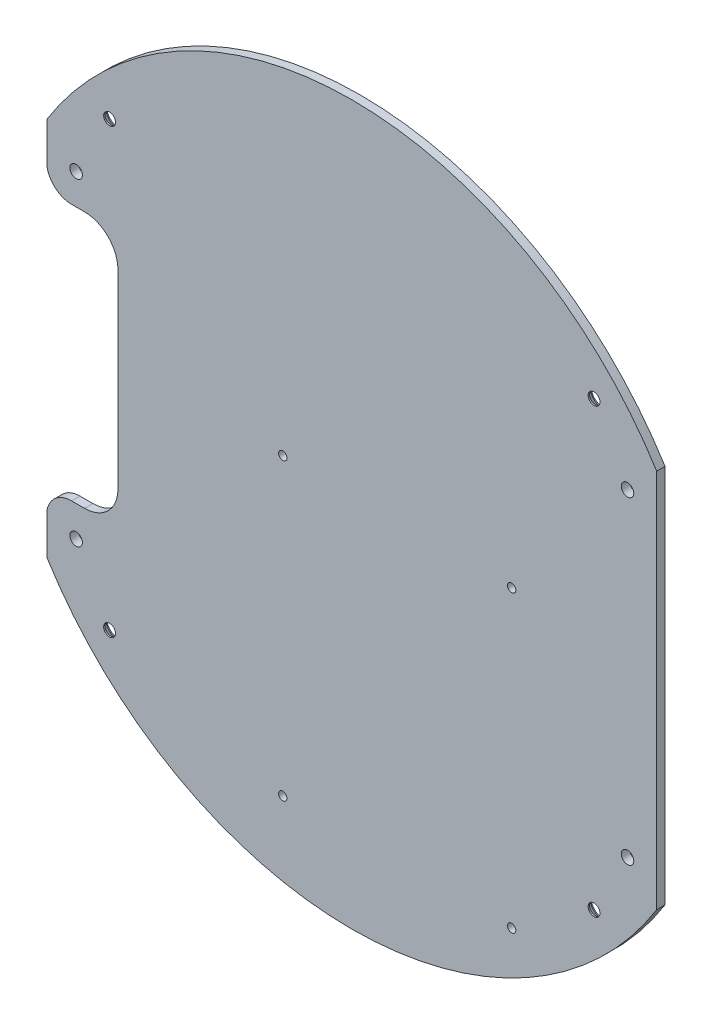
ISO-10303-21;
HEADER;
FILE_DESCRIPTION(('STEP AP214'),'2;1');
FILE_NAME('part.step','',(''),(''),'','','');
FILE_SCHEMA(('AUTOMOTIVE_DESIGN { 1 0 10303 214 1 1 1 1 }'));
ENDSEC;
DATA;
#1=APPLICATION_CONTEXT('core data for automotive mechanical design processes');
#2=APPLICATION_PROTOCOL_DEFINITION('international standard','automotive_design',2000,#1);
#3=PRODUCT_CONTEXT('',#1,'mechanical');
#4=PRODUCT('Part','Part','',(#3));
#5=PRODUCT_RELATED_PRODUCT_CATEGORY('part','',(#4));
#6=PRODUCT_DEFINITION_FORMATION('','',#4);
#7=PRODUCT_DEFINITION_CONTEXT('part definition',#1,'design');
#8=PRODUCT_DEFINITION('design','',#6,#7);
#9=PRODUCT_DEFINITION_SHAPE('','',#8);
#10=(LENGTH_UNIT() NAMED_UNIT(*) SI_UNIT(.MILLI.,.METRE.));
#11=(NAMED_UNIT(*) PLANE_ANGLE_UNIT() SI_UNIT($,.RADIAN.));
#12=(NAMED_UNIT(*) SI_UNIT($,.STERADIAN.) SOLID_ANGLE_UNIT());
#13=UNCERTAINTY_MEASURE_WITH_UNIT(LENGTH_MEASURE(1.E-05),#10,'distance_accuracy_value','');
#14=(GEOMETRIC_REPRESENTATION_CONTEXT(3) GLOBAL_UNCERTAINTY_ASSIGNED_CONTEXT((#13)) GLOBAL_UNIT_ASSIGNED_CONTEXT((#10,
#11,#12)) REPRESENTATION_CONTEXT('',''));
#15=CARTESIAN_POINT('',(0.,0.,0.));
#16=DIRECTION('',(0.,0.,1.));
#17=DIRECTION('',(1.,0.,0.));
#18=AXIS2_PLACEMENT_3D('',#15,#16,#17);
#19=CARTESIAN_POINT('',(0.,-63.5,3.175));
#20=DIRECTION('',(0.,0.,1.));
#21=DIRECTION('',(1.,0.,0.));
#22=AXIS2_PLACEMENT_3D('',#19,#20,#21);
#23=PLANE('',#22);
#24=CARTESIAN_POINT('',(-92.075,20.6375,3.17500000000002));
#25=DIRECTION('',(0.,0.,-1.));
#26=DIRECTION('',(-1.,0.,0.));
#27=AXIS2_PLACEMENT_3D('',#24,#25,#26);
#28=CIRCLE('',#27,2.2479);
#29=CARTESIAN_POINT('',(-94.3229,20.6375,3.17500000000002));
#30=VERTEX_POINT('',#29);
#31=EDGE_CURVE('E592',#30,#30,#28,.T.);
#32=ORIENTED_EDGE('',*,*,#31,.T.);
#33=EDGE_LOOP('',(#32));
#34=FACE_BOUND('',#33,.T.);
#35=CARTESIAN_POINT('',(92.075,-147.6375,3.17500000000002));
#36=DIRECTION('',(0.,0.,-1.));
#37=DIRECTION('',(-1.,0.,0.));
#38=AXIS2_PLACEMENT_3D('',#35,#36,#37);
#39=CIRCLE('',#38,2.2479);
#40=CARTESIAN_POINT('',(89.8271,-147.6375,3.17500000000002));
#41=VERTEX_POINT('',#40);
#42=EDGE_CURVE('E615',#41,#41,#39,.T.);
#43=ORIENTED_EDGE('',*,*,#42,.T.);
#44=EDGE_LOOP('',(#43));
#45=FACE_BOUND('',#44,.T.);
#46=CARTESIAN_POINT('',(60.7441,-169.291,3.17500000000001));
#47=DIRECTION('',(0.,0.,-1.));
#48=DIRECTION('',(0.,1.,0.));
#49=AXIS2_PLACEMENT_3D('',#46,#47,#48);
#50=CIRCLE('',#49,1.5875);
#51=CARTESIAN_POINT('',(60.7441,-167.7035,3.17500000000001));
#52=VERTEX_POINT('',#51);
#53=EDGE_CURVE('E630',#52,#52,#50,.T.);
#54=ORIENTED_EDGE('',*,*,#53,.T.);
#55=EDGE_LOOP('',(#54));
#56=FACE_BOUND('',#55,.T.);
#57=CARTESIAN_POINT('',(60.7441,-57.277,3.17500000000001));
#58=DIRECTION('',(0.,0.,-1.));
#59=DIRECTION('',(0.,1.,0.));
#60=AXIS2_PLACEMENT_3D('',#57,#58,#59);
#61=CIRCLE('',#60,1.5875);
#62=CARTESIAN_POINT('',(60.7441,-55.6895,3.17500000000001));
#63=VERTEX_POINT('',#62);
#64=EDGE_CURVE('E636',#63,#63,#61,.T.);
#65=ORIENTED_EDGE('',*,*,#64,.T.);
#66=EDGE_LOOP('',(#65));
#67=FACE_BOUND('',#66,.T.);
#68=CARTESIAN_POINT('',(-26.2509,-57.277,3.17500000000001));
#69=DIRECTION('',(0.,0.,-1.));
#70=DIRECTION('',(0.,1.,0.));
#71=AXIS2_PLACEMENT_3D('',#68,#69,#70);
#72=CIRCLE('',#71,1.5875);
#73=CARTESIAN_POINT('',(-26.2509,-55.6895,3.17500000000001));
#74=VERTEX_POINT('',#73);
#75=EDGE_CURVE('E642',#74,#74,#72,.T.);
#76=ORIENTED_EDGE('',*,*,#75,.T.);
#77=EDGE_LOOP('',(#76));
#78=FACE_BOUND('',#77,.T.);
#79=CARTESIAN_POINT('',(-26.2509,-169.291,3.17500000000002));
#80=DIRECTION('',(0.,0.,-1.));
#81=DIRECTION('',(0.,1.,0.));
#82=AXIS2_PLACEMENT_3D('',#79,#80,#81);
#83=CIRCLE('',#82,1.5875);
#84=CARTESIAN_POINT('',(-26.2509,-167.7035,3.17500000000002));
#85=VERTEX_POINT('',#84);
#86=EDGE_CURVE('E648',#85,#85,#83,.T.);
#87=ORIENTED_EDGE('',*,*,#86,.T.);
#88=EDGE_LOOP('',(#87));
#89=FACE_BOUND('',#88,.T.);
#90=CARTESIAN_POINT('',(-104.793923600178,-2.99719999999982,3.175));
#91=DIRECTION('',(0.,0.,1.));
#92=DIRECTION('',(-1.,0.,0.));
#93=AXIS2_PLACEMENT_3D('',#90,#91,#92);
#94=CIRCLE('',#93,2.38125000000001);
#95=CARTESIAN_POINT('',(-107.175173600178,-2.99719999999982,3.175));
#96=VERTEX_POINT('',#95);
#97=EDGE_CURVE('E651',#96,#96,#94,.T.);
#98=ORIENTED_EDGE('',*,*,#97,.F.);
#99=EDGE_LOOP('',(#98));
#100=FACE_BOUND('',#99,.T.);
#101=CARTESIAN_POINT('',(-104.793923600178,-124.0028,3.175));
#102=DIRECTION('',(0.,0.,1.));
#103=DIRECTION('',(1.,0.,0.));
#104=AXIS2_PLACEMENT_3D('',#101,#102,#103);
#105=CIRCLE('',#104,2.38125);
#106=CARTESIAN_POINT('',(-102.412673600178,-124.0028,3.175));
#107=VERTEX_POINT('',#106);
#108=EDGE_CURVE('E657',#107,#107,#105,.T.);
#109=ORIENTED_EDGE('',*,*,#108,.F.);
#110=EDGE_LOOP('',(#109));
#111=FACE_BOUND('',#110,.T.);
#112=CARTESIAN_POINT('',(104.793923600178,-124.0028,3.175));
#113=DIRECTION('',(0.,0.,1.));
#114=DIRECTION('',(-1.,0.,0.));
#115=AXIS2_PLACEMENT_3D('',#112,#113,#114);
#116=CIRCLE('',#115,2.38125);
#117=CARTESIAN_POINT('',(102.412673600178,-124.0028,3.175));
#118=VERTEX_POINT('',#117);
#119=EDGE_CURVE('E663',#118,#118,#116,.T.);
#120=ORIENTED_EDGE('',*,*,#119,.F.);
#121=EDGE_LOOP('',(#120));
#122=FACE_BOUND('',#121,.T.);
#123=CARTESIAN_POINT('',(104.793923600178,-2.99719999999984,3.175));
#124=DIRECTION('',(0.,0.,1.));
#125=DIRECTION('',(1.,0.,0.));
#126=AXIS2_PLACEMENT_3D('',#123,#124,#125);
#127=CIRCLE('',#126,2.38125000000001);
#128=CARTESIAN_POINT('',(107.175173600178,-2.99719999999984,3.175));
#129=VERTEX_POINT('',#128);
#130=EDGE_CURVE('E156',#129,#129,#127,.T.);
#131=ORIENTED_EDGE('',*,*,#130,.F.);
#132=EDGE_LOOP('',(#131));
#133=FACE_BOUND('',#132,.T.);
#134=DIRECTION('',(-1.,0.,0.));
#135=VECTOR('',#134,1.);
#136=CARTESIAN_POINT('',(-106.51914883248,-112.3065313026,3.175));
#137=LINE('',#136,#135);
#138=CARTESIAN_POINT('',(-101.6,-112.3065313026,3.175));
#139=VERTEX_POINT('',#138);
#140=CARTESIAN_POINT('',(-106.51914883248,-112.3065313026,3.175));
#141=VERTEX_POINT('',#140);
#142=EDGE_CURVE('E144',#139,#141,#137,.T.);
#143=ORIENTED_EDGE('',*,*,#142,.T.);
#144=CARTESIAN_POINT('',(-106.51914883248,-121.8315313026,3.175));
#145=DIRECTION('',(0.,0.,1.));
#146=DIRECTION('',(1.,0.,0.));
#147=AXIS2_PLACEMENT_3D('',#144,#145,#146);
#148=CIRCLE('',#147,9.525);
#149=CARTESIAN_POINT('',(-115.8875,-120.111176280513,3.175));
#150=VERTEX_POINT('',#149);
#151=EDGE_CURVE('E150',#141,#150,#148,.T.);
#152=ORIENTED_EDGE('',*,*,#151,.T.);
#153=DIRECTION('',(0.,1.,0.));
#154=VECTOR('',#153,1.);
#155=CARTESIAN_POINT('',(-115.8875,-135.6745313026,3.175));
#156=LINE('',#155,#154);
#157=CARTESIAN_POINT('',(-115.8875,-135.6745313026,3.175));
#158=VERTEX_POINT('',#157);
#159=EDGE_CURVE('E171',#158,#150,#156,.T.);
#160=ORIENTED_EDGE('',*,*,#159,.F.);
#161=CARTESIAN_POINT('',(0.,-63.5,3.175));
#162=DIRECTION('',(0.,0.,-1.));
#163=DIRECTION('',(1.,0.,0.));
#164=AXIS2_PLACEMENT_3D('',#161,#162,#163);
#165=CIRCLE('',#164,136.525);
#166=CARTESIAN_POINT('',(115.8875,-135.6745313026,3.175));
#167=VERTEX_POINT('',#166);
#168=EDGE_CURVE('E174',#167,#158,#165,.T.);
#169=ORIENTED_EDGE('',*,*,#168,.F.);
#170=DIRECTION('',(0.,1.,0.));
#171=VECTOR('',#170,1.);
#172=CARTESIAN_POINT('',(115.8875,8.67453130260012,3.175));
#173=LINE('',#172,#171);
#174=CARTESIAN_POINT('',(115.8875,8.67453130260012,3.175));
#175=VERTEX_POINT('',#174);
#176=EDGE_CURVE('E211',#167,#175,#173,.T.);
#177=ORIENTED_EDGE('',*,*,#176,.T.);
#178=CARTESIAN_POINT('',(0.,-63.5,3.175));
#179=DIRECTION('',(0.,0.,1.));
#180=DIRECTION('',(1.,0.,0.));
#181=AXIS2_PLACEMENT_3D('',#178,#179,#180);
#182=CIRCLE('',#181,136.525);
#183=CARTESIAN_POINT('',(-115.8875,8.67453130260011,3.175));
#184=VERTEX_POINT('',#183);
#185=EDGE_CURVE('E57',#175,#184,#182,.T.);
#186=ORIENTED_EDGE('',*,*,#185,.T.);
#187=DIRECTION('',(0.,-1.,0.));
#188=VECTOR('',#187,1.);
#189=CARTESIAN_POINT('',(-115.8875,8.6745313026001,3.175));
#190=LINE('',#189,#188);
#191=CARTESIAN_POINT('',(-115.8875,-6.88882371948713,3.175));
#192=VERTEX_POINT('',#191);
#193=EDGE_CURVE('E209',#184,#192,#190,.T.);
#194=ORIENTED_EDGE('',*,*,#193,.T.);
#195=CARTESIAN_POINT('',(-106.51914883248,-5.16846869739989,3.175));
#196=DIRECTION('',(0.,0.,-1.));
#197=DIRECTION('',(1.,0.,0.));
#198=AXIS2_PLACEMENT_3D('',#195,#196,#197);
#199=CIRCLE('',#198,9.525);
#200=CARTESIAN_POINT('',(-106.51914883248,-14.6934686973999,3.175));
#201=VERTEX_POINT('',#200);
#202=EDGE_CURVE('E135',#201,#192,#199,.T.);
#203=ORIENTED_EDGE('',*,*,#202,.F.);
#204=DIRECTION('',(-1.,0.,0.));
#205=VECTOR('',#204,1.);
#206=CARTESIAN_POINT('',(-106.51914883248,-14.6934686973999,3.175));
#207=LINE('',#206,#205);
#208=CARTESIAN_POINT('',(-101.6,-14.6934686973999,3.175));
#209=VERTEX_POINT('',#208);
#210=EDGE_CURVE('E183',#209,#201,#207,.T.);
#211=ORIENTED_EDGE('',*,*,#210,.F.);
#212=CARTESIAN_POINT('',(-101.6,-27.3934686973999,3.175));
#213=DIRECTION('',(0.,0.,1.));
#214=DIRECTION('',(1.,0.,0.));
#215=AXIS2_PLACEMENT_3D('',#212,#213,#214);
#216=CIRCLE('',#215,12.7);
#217=CARTESIAN_POINT('',(-88.9,-27.3934686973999,3.175));
#218=VERTEX_POINT('',#217);
#219=EDGE_CURVE('E130',#218,#209,#216,.T.);
#220=ORIENTED_EDGE('',*,*,#219,.F.);
#221=DIRECTION('',(0.,1.,0.));
#222=VECTOR('',#221,1.);
#223=CARTESIAN_POINT('',(-88.9,-27.3934686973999,3.175));
#224=LINE('',#223,#222);
#225=CARTESIAN_POINT('',(-88.9,-99.6065313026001,3.175));
#226=VERTEX_POINT('',#225);
#227=EDGE_CURVE('E122',#226,#218,#224,.T.);
#228=ORIENTED_EDGE('',*,*,#227,.F.);
#229=CARTESIAN_POINT('',(-101.6,-99.6065313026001,3.175));
#230=DIRECTION('',(0.,0.,-1.));
#231=DIRECTION('',(1.,0.,0.));
#232=AXIS2_PLACEMENT_3D('',#229,#230,#231);
#233=CIRCLE('',#232,12.7);
#234=EDGE_CURVE('E127',#226,#139,#233,.T.);
#235=ORIENTED_EDGE('',*,*,#234,.T.);
#236=EDGE_LOOP('',(#143,#152,#160,#169,#177,#186,#194,#203,#211,#220,#228,#235));
#237=FACE_BOUND('',#236,.T.);
#238=CARTESIAN_POINT('',(92.075,20.6375,3.17500000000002));
#239=DIRECTION('',(0.,0.,-1.));
#240=DIRECTION('',(-1.,0.,0.));
#241=AXIS2_PLACEMENT_3D('',#238,#239,#240);
#242=CIRCLE('',#241,2.2479);
#243=CARTESIAN_POINT('',(89.8271,20.6375,3.17500000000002));
#244=VERTEX_POINT('',#243);
#245=EDGE_CURVE('E603',#244,#244,#242,.T.);
#246=ORIENTED_EDGE('',*,*,#245,.T.);
#247=EDGE_LOOP('',(#246));
#248=FACE_BOUND('',#247,.T.);
#249=CARTESIAN_POINT('',(-92.075,-147.6375,3.17500000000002));
#250=DIRECTION('',(0.,0.,-1.));
#251=DIRECTION('',(-1.,0.,0.));
#252=AXIS2_PLACEMENT_3D('',#249,#250,#251);
#253=CIRCLE('',#252,2.2479);
#254=CARTESIAN_POINT('',(-94.3229,-147.6375,3.17500000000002));
#255=VERTEX_POINT('',#254);
#256=EDGE_CURVE('E579',#255,#255,#253,.T.);
#257=ORIENTED_EDGE('',*,*,#256,.T.);
#258=EDGE_LOOP('',(#257));
#259=FACE_BOUND('',#258,.T.);
#260=ADVANCED_FACE('F34',(#34,#45,#56,#67,#78,#89,#100,#111,#122,#133,#237,#248,#259),#23,.T.);
#261=CARTESIAN_POINT('',(0.,-63.5,0.));
#262=DIRECTION('',(0.,0.,1.));
#263=DIRECTION('',(1.,0.,0.));
#264=AXIS2_PLACEMENT_3D('',#261,#262,#263);
#265=PLANE('',#264);
#266=CARTESIAN_POINT('',(-92.075,-147.6375,0.));
#267=DIRECTION('',(0.,0.,-1.));
#268=DIRECTION('',(-1.,0.,0.));
#269=AXIS2_PLACEMENT_3D('',#266,#267,#268);
#270=CIRCLE('',#269,4.21639999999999);
#271=CARTESIAN_POINT('',(-96.2914,-147.6375,0.));
#272=VERTEX_POINT('',#271);
#273=EDGE_CURVE('E586',#272,#272,#270,.T.);
#274=ORIENTED_EDGE('',*,*,#273,.F.);
#275=EDGE_LOOP('',(#274));
#276=FACE_BOUND('',#275,.T.);
#277=CARTESIAN_POINT('',(-92.075,20.6375,0.));
#278=DIRECTION('',(0.,0.,-1.));
#279=DIRECTION('',(-1.,0.,0.));
#280=AXIS2_PLACEMENT_3D('',#277,#278,#279);
#281=CIRCLE('',#280,4.21639999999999);
#282=CARTESIAN_POINT('',(-96.2914,20.6375,0.));
#283=VERTEX_POINT('',#282);
#284=EDGE_CURVE('E600',#283,#283,#281,.T.);
#285=ORIENTED_EDGE('',*,*,#284,.F.);
#286=EDGE_LOOP('',(#285));
#287=FACE_BOUND('',#286,.T.);
#288=CARTESIAN_POINT('',(92.075,20.6375,0.));
#289=DIRECTION('',(0.,0.,-1.));
#290=DIRECTION('',(-1.,0.,0.));
#291=AXIS2_PLACEMENT_3D('',#288,#289,#290);
#292=CIRCLE('',#291,4.21639999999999);
#293=CARTESIAN_POINT('',(87.8586,20.6375,0.));
#294=VERTEX_POINT('',#293);
#295=EDGE_CURVE('E612',#294,#294,#292,.T.);
#296=ORIENTED_EDGE('',*,*,#295,.F.);
#297=EDGE_LOOP('',(#296));
#298=FACE_BOUND('',#297,.T.);
#299=CARTESIAN_POINT('',(92.075,-147.6375,0.));
#300=DIRECTION('',(0.,0.,-1.));
#301=DIRECTION('',(-1.,0.,0.));
#302=AXIS2_PLACEMENT_3D('',#299,#300,#301);
#303=CIRCLE('',#302,4.21639999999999);
#304=CARTESIAN_POINT('',(87.8586,-147.6375,0.));
#305=VERTEX_POINT('',#304);
#306=EDGE_CURVE('E624',#305,#305,#303,.T.);
#307=ORIENTED_EDGE('',*,*,#306,.F.);
#308=EDGE_LOOP('',(#307));
#309=FACE_BOUND('',#308,.T.);
#310=CARTESIAN_POINT('',(60.7441,-169.291,0.));
#311=DIRECTION('',(0.,0.,-1.));
#312=DIRECTION('',(0.,1.,0.));
#313=AXIS2_PLACEMENT_3D('',#310,#311,#312);
#314=CIRCLE('',#313,1.5875);
#315=CARTESIAN_POINT('',(60.7441,-167.7035,0.));
#316=VERTEX_POINT('',#315);
#317=EDGE_CURVE('E627',#316,#316,#314,.T.);
#318=ORIENTED_EDGE('',*,*,#317,.F.);
#319=EDGE_LOOP('',(#318));
#320=FACE_BOUND('',#319,.T.);
#321=CARTESIAN_POINT('',(60.7441,-57.277,0.));
#322=DIRECTION('',(0.,0.,-1.));
#323=DIRECTION('',(0.,1.,0.));
#324=AXIS2_PLACEMENT_3D('',#321,#322,#323);
#325=CIRCLE('',#324,1.5875);
#326=CARTESIAN_POINT('',(60.7441,-55.6895,0.));
#327=VERTEX_POINT('',#326);
#328=EDGE_CURVE('E633',#327,#327,#325,.T.);
#329=ORIENTED_EDGE('',*,*,#328,.F.);
#330=EDGE_LOOP('',(#329));
#331=FACE_BOUND('',#330,.T.);
#332=CARTESIAN_POINT('',(-26.2509,-57.277,0.));
#333=DIRECTION('',(0.,0.,-1.));
#334=DIRECTION('',(0.,1.,0.));
#335=AXIS2_PLACEMENT_3D('',#332,#333,#334);
#336=CIRCLE('',#335,1.5875);
#337=CARTESIAN_POINT('',(-26.2509,-55.6895,0.));
#338=VERTEX_POINT('',#337);
#339=EDGE_CURVE('E639',#338,#338,#336,.T.);
#340=ORIENTED_EDGE('',*,*,#339,.F.);
#341=EDGE_LOOP('',(#340));
#342=FACE_BOUND('',#341,.T.);
#343=CARTESIAN_POINT('',(-26.2509,-169.291,0.));
#344=DIRECTION('',(0.,0.,-1.));
#345=DIRECTION('',(0.,1.,0.));
#346=AXIS2_PLACEMENT_3D('',#343,#344,#345);
#347=CIRCLE('',#346,1.5875);
#348=CARTESIAN_POINT('',(-26.2509,-167.7035,0.));
#349=VERTEX_POINT('',#348);
#350=EDGE_CURVE('E645',#349,#349,#347,.T.);
#351=ORIENTED_EDGE('',*,*,#350,.F.);
#352=EDGE_LOOP('',(#351));
#353=FACE_BOUND('',#352,.T.);
#354=CARTESIAN_POINT('',(-104.793923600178,-2.99719999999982,0.));
#355=DIRECTION('',(0.,0.,1.));
#356=DIRECTION('',(-1.,0.,0.));
#357=AXIS2_PLACEMENT_3D('',#354,#355,#356);
#358=CIRCLE('',#357,2.38125000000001);
#359=CARTESIAN_POINT('',(-107.175173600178,-2.99719999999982,0.));
#360=VERTEX_POINT('',#359);
#361=EDGE_CURVE('E654',#360,#360,#358,.T.);
#362=ORIENTED_EDGE('',*,*,#361,.T.);
#363=EDGE_LOOP('',(#362));
#364=FACE_BOUND('',#363,.T.);
#365=CARTESIAN_POINT('',(-104.793923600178,-124.0028,0.));
#366=DIRECTION('',(0.,0.,1.));
#367=DIRECTION('',(1.,0.,0.));
#368=AXIS2_PLACEMENT_3D('',#365,#366,#367);
#369=CIRCLE('',#368,2.38125);
#370=CARTESIAN_POINT('',(-102.412673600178,-124.0028,0.));
#371=VERTEX_POINT('',#370);
#372=EDGE_CURVE('E660',#371,#371,#369,.T.);
#373=ORIENTED_EDGE('',*,*,#372,.T.);
#374=EDGE_LOOP('',(#373));
#375=FACE_BOUND('',#374,.T.);
#376=CARTESIAN_POINT('',(104.793923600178,-124.0028,0.));
#377=DIRECTION('',(0.,0.,1.));
#378=DIRECTION('',(-1.,0.,0.));
#379=AXIS2_PLACEMENT_3D('',#376,#377,#378);
#380=CIRCLE('',#379,2.38125);
#381=CARTESIAN_POINT('',(102.412673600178,-124.0028,0.));
#382=VERTEX_POINT('',#381);
#383=EDGE_CURVE('E666',#382,#382,#380,.T.);
#384=ORIENTED_EDGE('',*,*,#383,.T.);
#385=EDGE_LOOP('',(#384));
#386=FACE_BOUND('',#385,.T.);
#387=CARTESIAN_POINT('',(104.793923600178,-2.99719999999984,0.));
#388=DIRECTION('',(0.,0.,1.));
#389=DIRECTION('',(1.,0.,0.));
#390=AXIS2_PLACEMENT_3D('',#387,#388,#389);
#391=CIRCLE('',#390,2.38125000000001);
#392=CARTESIAN_POINT('',(107.175173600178,-2.99719999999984,0.));
#393=VERTEX_POINT('',#392);
#394=EDGE_CURVE('E151',#393,#393,#391,.T.);
#395=ORIENTED_EDGE('',*,*,#394,.T.);
#396=EDGE_LOOP('',(#395));
#397=FACE_BOUND('',#396,.T.);
#398=CARTESIAN_POINT('',(-106.51914883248,-121.8315313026,0.));
#399=DIRECTION('',(0.,0.,1.));
#400=DIRECTION('',(1.,0.,0.));
#401=AXIS2_PLACEMENT_3D('',#398,#399,#400);
#402=CIRCLE('',#401,9.525);
#403=CARTESIAN_POINT('',(-106.51914883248,-112.3065313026,0.));
#404=VERTEX_POINT('',#403);
#405=CARTESIAN_POINT('',(-115.8875,-120.111176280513,0.));
#406=VERTEX_POINT('',#405);
#407=EDGE_CURVE('E162',#404,#406,#402,.T.);
#408=ORIENTED_EDGE('',*,*,#407,.F.);
#409=DIRECTION('',(-1.,0.,0.));
#410=VECTOR('',#409,1.);
#411=CARTESIAN_POINT('',(0.,-112.3065313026,0.));
#412=LINE('',#411,#410);
#413=CARTESIAN_POINT('',(-101.6,-112.3065313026,0.));
#414=VERTEX_POINT('',#413);
#415=EDGE_CURVE('E11',#414,#404,#412,.T.);
#416=ORIENTED_EDGE('',*,*,#415,.F.);
#417=CARTESIAN_POINT('',(-101.6,-99.6065313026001,0.));
#418=DIRECTION('',(0.,0.,1.));
#419=DIRECTION('',(1.,0.,0.));
#420=AXIS2_PLACEMENT_3D('',#417,#418,#419);
#421=CIRCLE('',#420,12.7);
#422=CARTESIAN_POINT('',(-88.9,-99.6065313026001,0.));
#423=VERTEX_POINT('',#422);
#424=EDGE_CURVE('E42',#423,#414,#421,.F.);
#425=ORIENTED_EDGE('',*,*,#424,.F.);
#426=DIRECTION('',(0.,1.,0.));
#427=VECTOR('',#426,1.);
#428=CARTESIAN_POINT('',(-88.9,-63.5,0.));
#429=LINE('',#428,#427);
#430=CARTESIAN_POINT('',(-88.9,-27.3934686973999,0.));
#431=VERTEX_POINT('',#430);
#432=EDGE_CURVE('E140',#423,#431,#429,.T.);
#433=ORIENTED_EDGE('',*,*,#432,.T.);
#434=CARTESIAN_POINT('',(-101.6,-27.3934686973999,0.));
#435=DIRECTION('',(0.,0.,1.));
#436=DIRECTION('',(1.,0.,0.));
#437=AXIS2_PLACEMENT_3D('',#434,#435,#436);
#438=CIRCLE('',#437,12.7);
#439=CARTESIAN_POINT('',(-101.6,-14.6934686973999,0.));
#440=VERTEX_POINT('',#439);
#441=EDGE_CURVE('E134',#431,#440,#438,.T.);
#442=ORIENTED_EDGE('',*,*,#441,.T.);
#443=DIRECTION('',(-1.,0.,0.));
#444=VECTOR('',#443,1.);
#445=CARTESIAN_POINT('',(-106.51914883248,-14.6934686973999,0.));
#446=LINE('',#445,#444);
#447=CARTESIAN_POINT('',(-106.51914883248,-14.6934686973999,0.));
#448=VERTEX_POINT('',#447);
#449=EDGE_CURVE('E189',#440,#448,#446,.T.);
#450=ORIENTED_EDGE('',*,*,#449,.T.);
#451=CARTESIAN_POINT('',(-106.51914883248,-5.16846869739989,0.));
#452=DIRECTION('',(0.,0.,-1.));
#453=DIRECTION('',(1.,0.,0.));
#454=AXIS2_PLACEMENT_3D('',#451,#452,#453);
#455=CIRCLE('',#454,9.525);
#456=CARTESIAN_POINT('',(-115.8875,-6.88882371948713,0.));
#457=VERTEX_POINT('',#456);
#458=EDGE_CURVE('E49',#448,#457,#455,.T.);
#459=ORIENTED_EDGE('',*,*,#458,.T.);
#460=DIRECTION('',(0.,-1.,0.));
#461=VECTOR('',#460,1.);
#462=CARTESIAN_POINT('',(-115.8875,8.6745313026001,0.));
#463=LINE('',#462,#461);
#464=CARTESIAN_POINT('',(-115.8875,8.67453130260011,0.));
#465=VERTEX_POINT('',#464);
#466=EDGE_CURVE('E202',#465,#457,#463,.T.);
#467=ORIENTED_EDGE('',*,*,#466,.F.);
#468=CARTESIAN_POINT('',(0.,-63.5,0.));
#469=DIRECTION('',(0.,0.,1.));
#470=DIRECTION('',(1.,0.,0.));
#471=AXIS2_PLACEMENT_3D('',#468,#469,#470);
#472=CIRCLE('',#471,136.525);
#473=CARTESIAN_POINT('',(115.8875,8.67453130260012,0.));
#474=VERTEX_POINT('',#473);
#475=EDGE_CURVE('E207',#474,#465,#472,.T.);
#476=ORIENTED_EDGE('',*,*,#475,.F.);
#477=DIRECTION('',(0.,1.,0.));
#478=VECTOR('',#477,1.);
#479=CARTESIAN_POINT('',(115.8875,8.67453130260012,0.));
#480=LINE('',#479,#478);
#481=CARTESIAN_POINT('',(115.8875,-135.6745313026,0.));
#482=VERTEX_POINT('',#481);
#483=EDGE_CURVE('E205',#482,#474,#480,.T.);
#484=ORIENTED_EDGE('',*,*,#483,.F.);
#485=CARTESIAN_POINT('',(0.,-63.5,0.));
#486=DIRECTION('',(0.,0.,-1.));
#487=DIRECTION('',(1.,0.,0.));
#488=AXIS2_PLACEMENT_3D('',#485,#486,#487);
#489=CIRCLE('',#488,136.525);
#490=CARTESIAN_POINT('',(-115.8875,-135.6745313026,0.));
#491=VERTEX_POINT('',#490);
#492=EDGE_CURVE('E168',#482,#491,#489,.T.);
#493=ORIENTED_EDGE('',*,*,#492,.T.);
#494=DIRECTION('',(0.,1.,0.));
#495=VECTOR('',#494,1.);
#496=CARTESIAN_POINT('',(-115.8875,-135.6745313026,0.));
#497=LINE('',#496,#495);
#498=EDGE_CURVE('E165',#491,#406,#497,.T.);
#499=ORIENTED_EDGE('',*,*,#498,.T.);
#500=EDGE_LOOP('',(#408,#416,#425,#433,#442,#450,#459,#467,#476,#484,#493,#499));
#501=FACE_BOUND('',#500,.T.);
#502=ADVANCED_FACE('F233',(#276,#287,#298,#309,#320,#331,#342,#353,#364,#375,#386,#397,#501),
#265,.F.);
#503=CARTESIAN_POINT('',(-115.8875,-135.6745313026,3.175));
#504=DIRECTION('',(-1.,0.,0.));
#505=DIRECTION('',(0.,-1.,0.));
#506=AXIS2_PLACEMENT_3D('',#503,#504,#505);
#507=PLANE('',#506);
#508=ORIENTED_EDGE('',*,*,#159,.T.);
#509=DIRECTION('',(0.,0.,1.));
#510=VECTOR('',#509,1.);
#511=CARTESIAN_POINT('',(-115.8875,-120.111176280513,-5.00000000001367E-05));
#512=LINE('',#511,#510);
#513=EDGE_CURVE('E221',#150,#406,#512,.F.);
#514=ORIENTED_EDGE('',*,*,#513,.T.);
#515=ORIENTED_EDGE('',*,*,#498,.F.);
#516=DIRECTION('',(0.,0.,-1.));
#517=VECTOR('',#516,1.);
#518=CARTESIAN_POINT('',(-115.8875,-135.6745313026,3.175));
#519=LINE('',#518,#517);
#520=EDGE_CURVE('E180',#158,#491,#519,.T.);
#521=ORIENTED_EDGE('',*,*,#520,.F.);
#522=EDGE_LOOP('',(#508,#514,#515,#521));
#523=FACE_BOUND('',#522,.T.);
#524=ADVANCED_FACE('F239',(#523),#507,.T.);
#525=CARTESIAN_POINT('',(-115.8875,8.6745313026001,3.175));
#526=DIRECTION('',(1.,0.,0.));
#527=DIRECTION('',(0.,1.,0.));
#528=AXIS2_PLACEMENT_3D('',#525,#526,#527);
#529=PLANE('',#528);
#530=ORIENTED_EDGE('',*,*,#466,.T.);
#531=DIRECTION('',(0.,0.,1.));
#532=VECTOR('',#531,1.);
#533=CARTESIAN_POINT('',(-115.8875,-6.88882371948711,0.));
#534=LINE('',#533,#532);
#535=EDGE_CURVE('E196',#457,#192,#534,.T.);
#536=ORIENTED_EDGE('',*,*,#535,.T.);
#537=ORIENTED_EDGE('',*,*,#193,.F.);
#538=DIRECTION('',(0.,0.,-1.));
#539=VECTOR('',#538,1.);
#540=CARTESIAN_POINT('',(-115.8875,8.67453130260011,3.175));
#541=LINE('',#540,#539);
#542=EDGE_CURVE('E214',#184,#465,#541,.T.);
#543=ORIENTED_EDGE('',*,*,#542,.T.);
#544=EDGE_LOOP('',(#530,#536,#537,#543));
#545=FACE_BOUND('',#544,.T.);
#546=ADVANCED_FACE('F36',(#545),#529,.F.);
#547=CARTESIAN_POINT('',(115.8875,8.67453130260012,3.175));
#548=DIRECTION('',(-1.,0.,0.));
#549=DIRECTION('',(0.,-1.,0.));
#550=AXIS2_PLACEMENT_3D('',#547,#548,#549);
#551=PLANE('',#550);
#552=ORIENTED_EDGE('',*,*,#483,.T.);
#553=DIRECTION('',(0.,0.,-1.));
#554=VECTOR('',#553,1.);
#555=CARTESIAN_POINT('',(115.8875,8.67453130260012,3.175));
#556=LINE('',#555,#554);
#557=EDGE_CURVE('E217',#175,#474,#556,.T.);
#558=ORIENTED_EDGE('',*,*,#557,.F.);
#559=ORIENTED_EDGE('',*,*,#176,.F.);
#560=DIRECTION('',(0.,0.,-1.));
#561=VECTOR('',#560,1.);
#562=CARTESIAN_POINT('',(115.8875,-135.6745313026,3.175));
#563=LINE('',#562,#561);
#564=EDGE_CURVE('E177',#167,#482,#563,.T.);
#565=ORIENTED_EDGE('',*,*,#564,.T.);
#566=EDGE_LOOP('',(#552,#558,#559,#565));
#567=FACE_BOUND('',#566,.T.);
#568=ADVANCED_FACE('F247',(#567),#551,.F.);
#569=CARTESIAN_POINT('',(0.,-63.5,3.175));
#570=DIRECTION('',(0.,0.,-1.));
#571=DIRECTION('',(-1.,0.,0.));
#572=AXIS2_PLACEMENT_3D('',#569,#570,#571);
#573=CYLINDRICAL_SURFACE('',#572,136.525);
#574=ORIENTED_EDGE('',*,*,#475,.T.);
#575=ORIENTED_EDGE('',*,*,#542,.F.);
#576=ORIENTED_EDGE('',*,*,#185,.F.);
#577=ORIENTED_EDGE('',*,*,#557,.T.);
#578=EDGE_LOOP('',(#574,#575,#576,#577));
#579=FACE_BOUND('',#578,.T.);
#580=ADVANCED_FACE('F251',(#579),#573,.T.);
#581=CARTESIAN_POINT('',(-88.9,-27.3934686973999,0.));
#582=DIRECTION('',(1.,0.,0.));
#583=DIRECTION('',(0.,1.,0.));
#584=AXIS2_PLACEMENT_3D('',#581,#582,#583);
#585=PLANE('',#584);
#586=ORIENTED_EDGE('',*,*,#227,.T.);
#587=DIRECTION('',(0.,0.,1.));
#588=VECTOR('',#587,1.);
#589=CARTESIAN_POINT('',(-88.9,-27.3934686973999,0.));
#590=LINE('',#589,#588);
#591=EDGE_CURVE('E194',#431,#218,#590,.T.);
#592=ORIENTED_EDGE('',*,*,#591,.F.);
#593=ORIENTED_EDGE('',*,*,#432,.F.);
#594=DIRECTION('',(0.,0.,1.));
#595=VECTOR('',#594,1.);
#596=CARTESIAN_POINT('',(-88.9,-99.6065313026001,-5.00000000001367E-05));
#597=LINE('',#596,#595);
#598=EDGE_CURVE('E138',#423,#226,#597,.T.);
#599=ORIENTED_EDGE('',*,*,#598,.T.);
#600=EDGE_LOOP('',(#586,#592,#593,#599));
#601=FACE_BOUND('',#600,.T.);
#602=ADVANCED_FACE('F139',(#601),#585,.F.);
#603=CARTESIAN_POINT('',(-106.51914883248,-5.16846869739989,0.));
#604=DIRECTION('',(0.,0.,1.));
#605=DIRECTION('',(1.,0.,0.));
#606=AXIS2_PLACEMENT_3D('',#603,#604,#605);
#607=CYLINDRICAL_SURFACE('',#606,9.525);
#608=ORIENTED_EDGE('',*,*,#458,.F.);
#609=DIRECTION('',(0.,0.,1.));
#610=VECTOR('',#609,1.);
#611=CARTESIAN_POINT('',(-106.51914883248,-14.6934686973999,0.));
#612=LINE('',#611,#610);
#613=EDGE_CURVE('E197',#448,#201,#612,.T.);
#614=ORIENTED_EDGE('',*,*,#613,.T.);
#615=ORIENTED_EDGE('',*,*,#202,.T.);
#616=ORIENTED_EDGE('',*,*,#535,.F.);
#617=EDGE_LOOP('',(#608,#614,#615,#616));
#618=FACE_BOUND('',#617,.T.);
#619=ADVANCED_FACE('F256',(#618),#607,.T.);
#620=CARTESIAN_POINT('',(-101.6,-27.3934686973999,0.));
#621=DIRECTION('',(0.,0.,1.));
#622=DIRECTION('',(1.,0.,0.));
#623=AXIS2_PLACEMENT_3D('',#620,#621,#622);
#624=CYLINDRICAL_SURFACE('',#623,12.7);
#625=ORIENTED_EDGE('',*,*,#219,.T.);
#626=DIRECTION('',(0.,0.,1.));
#627=VECTOR('',#626,1.);
#628=CARTESIAN_POINT('',(-101.6,-14.6934686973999,0.));
#629=LINE('',#628,#627);
#630=EDGE_CURVE('E193',#440,#209,#629,.T.);
#631=ORIENTED_EDGE('',*,*,#630,.F.);
#632=ORIENTED_EDGE('',*,*,#441,.F.);
#633=ORIENTED_EDGE('',*,*,#591,.T.);
#634=EDGE_LOOP('',(#625,#631,#632,#633));
#635=FACE_BOUND('',#634,.T.);
#636=ADVANCED_FACE('F262',(#635),#624,.F.);
#637=CARTESIAN_POINT('',(-106.51914883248,-14.6934686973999,0.));
#638=DIRECTION('',(0.,1.,0.));
#639=DIRECTION('',(-1.,0.,0.));
#640=AXIS2_PLACEMENT_3D('',#637,#638,#639);
#641=PLANE('',#640);
#642=ORIENTED_EDGE('',*,*,#210,.T.);
#643=ORIENTED_EDGE('',*,*,#613,.F.);
#644=ORIENTED_EDGE('',*,*,#449,.F.);
#645=ORIENTED_EDGE('',*,*,#630,.T.);
#646=EDGE_LOOP('',(#642,#643,#644,#645));
#647=FACE_BOUND('',#646,.T.);
#648=ADVANCED_FACE('F259',(#647),#641,.F.);
#649=CARTESIAN_POINT('',(0.,-63.5,3.175));
#650=DIRECTION('',(0.,0.,-1.));
#651=DIRECTION('',(-1.,0.,0.));
#652=AXIS2_PLACEMENT_3D('',#649,#650,#651);
#653=CYLINDRICAL_SURFACE('',#652,136.525);
#654=ORIENTED_EDGE('',*,*,#492,.F.);
#655=ORIENTED_EDGE('',*,*,#564,.F.);
#656=ORIENTED_EDGE('',*,*,#168,.T.);
#657=ORIENTED_EDGE('',*,*,#520,.T.);
#658=EDGE_LOOP('',(#654,#655,#656,#657));
#659=FACE_BOUND('',#658,.T.);
#660=ADVANCED_FACE('F245',(#659),#653,.T.);
#661=CARTESIAN_POINT('',(-101.6,-99.6065313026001,-5.00000000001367E-05));
#662=DIRECTION('',(0.,0.,1.));
#663=DIRECTION('',(1.,0.,0.));
#664=AXIS2_PLACEMENT_3D('',#661,#662,#663);
#665=CYLINDRICAL_SURFACE('',#664,12.7);
#666=ORIENTED_EDGE('',*,*,#424,.T.);
#667=DIRECTION('',(0.,0.,1.));
#668=VECTOR('',#667,1.);
#669=CARTESIAN_POINT('',(-101.6,-112.3065313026,-5.00000000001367E-05));
#670=LINE('',#669,#668);
#671=EDGE_CURVE('E148',#414,#139,#670,.T.);
#672=ORIENTED_EDGE('',*,*,#671,.T.);
#673=ORIENTED_EDGE('',*,*,#234,.F.);
#674=ORIENTED_EDGE('',*,*,#598,.F.);
#675=EDGE_LOOP('',(#666,#672,#673,#674));
#676=FACE_BOUND('',#675,.T.);
#677=ADVANCED_FACE('F146',(#676),#665,.F.);
#678=CARTESIAN_POINT('',(-106.51914883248,-112.3065313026,-5.00000000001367E-05));
#679=DIRECTION('',(0.,1.,0.));
#680=DIRECTION('',(-1.,0.,0.));
#681=AXIS2_PLACEMENT_3D('',#678,#679,#680);
#682=PLANE('',#681);
#683=ORIENTED_EDGE('',*,*,#415,.T.);
#684=DIRECTION('',(0.,0.,1.));
#685=VECTOR('',#684,1.);
#686=CARTESIAN_POINT('',(-106.51914883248,-112.3065313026,-5.00000000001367E-05));
#687=LINE('',#686,#685);
#688=EDGE_CURVE('E143',#404,#141,#687,.T.);
#689=ORIENTED_EDGE('',*,*,#688,.T.);
#690=ORIENTED_EDGE('',*,*,#142,.F.);
#691=ORIENTED_EDGE('',*,*,#671,.F.);
#692=EDGE_LOOP('',(#683,#689,#690,#691));
#693=FACE_BOUND('',#692,.T.);
#694=ADVANCED_FACE('F230',(#693),#682,.T.);
#695=CARTESIAN_POINT('',(-106.51914883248,-121.8315313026,-5.00000000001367E-05));
#696=DIRECTION('',(0.,0.,1.));
#697=DIRECTION('',(1.,0.,0.));
#698=AXIS2_PLACEMENT_3D('',#695,#696,#697);
#699=CYLINDRICAL_SURFACE('',#698,9.525);
#700=ORIENTED_EDGE('',*,*,#407,.T.);
#701=ORIENTED_EDGE('',*,*,#513,.F.);
#702=ORIENTED_EDGE('',*,*,#151,.F.);
#703=ORIENTED_EDGE('',*,*,#688,.F.);
#704=EDGE_LOOP('',(#700,#701,#702,#703));
#705=FACE_BOUND('',#704,.T.);
#706=ADVANCED_FACE('F236',(#705),#699,.T.);
#707=CARTESIAN_POINT('',(104.793923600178,-2.99719999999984,0.));
#708=DIRECTION('',(0.,0.,1.));
#709=DIRECTION('',(1.,0.,0.));
#710=AXIS2_PLACEMENT_3D('',#707,#708,#709);
#711=CYLINDRICAL_SURFACE('',#710,2.38125000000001);
#712=ORIENTED_EDGE('',*,*,#394,.F.);
#713=EDGE_LOOP('',(#712));
#714=FACE_BOUND('',#713,.T.);
#715=ORIENTED_EDGE('',*,*,#130,.T.);
#716=EDGE_LOOP('',(#715));
#717=FACE_BOUND('',#716,.T.);
#718=ADVANCED_FACE('F362',(#714,#717),#711,.F.);
#719=CARTESIAN_POINT('',(104.793923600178,-124.0028,0.));
#720=DIRECTION('',(0.,0.,1.));
#721=DIRECTION('',(1.,0.,0.));
#722=AXIS2_PLACEMENT_3D('',#719,#720,#721);
#723=CYLINDRICAL_SURFACE('',#722,2.38125);
#724=ORIENTED_EDGE('',*,*,#383,.F.);
#725=EDGE_LOOP('',(#724));
#726=FACE_BOUND('',#725,.T.);
#727=ORIENTED_EDGE('',*,*,#119,.T.);
#728=EDGE_LOOP('',(#727));
#729=FACE_BOUND('',#728,.T.);
#730=ADVANCED_FACE('F371',(#726,#729),#723,.F.);
#731=CARTESIAN_POINT('',(-104.793923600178,-124.0028,0.));
#732=DIRECTION('',(0.,0.,1.));
#733=DIRECTION('',(1.,0.,0.));
#734=AXIS2_PLACEMENT_3D('',#731,#732,#733);
#735=CYLINDRICAL_SURFACE('',#734,2.38125);
#736=ORIENTED_EDGE('',*,*,#372,.F.);
#737=EDGE_LOOP('',(#736));
#738=FACE_BOUND('',#737,.T.);
#739=ORIENTED_EDGE('',*,*,#108,.T.);
#740=EDGE_LOOP('',(#739));
#741=FACE_BOUND('',#740,.T.);
#742=ADVANCED_FACE('F381',(#738,#741),#735,.F.);
#743=CARTESIAN_POINT('',(-104.793923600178,-2.99719999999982,0.));
#744=DIRECTION('',(0.,0.,1.));
#745=DIRECTION('',(1.,0.,0.));
#746=AXIS2_PLACEMENT_3D('',#743,#744,#745);
#747=CYLINDRICAL_SURFACE('',#746,2.38125000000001);
#748=ORIENTED_EDGE('',*,*,#361,.F.);
#749=EDGE_LOOP('',(#748));
#750=FACE_BOUND('',#749,.T.);
#751=ORIENTED_EDGE('',*,*,#97,.T.);
#752=EDGE_LOOP('',(#751));
#753=FACE_BOUND('',#752,.T.);
#754=ADVANCED_FACE('F391',(#750,#753),#747,.F.);
#755=CARTESIAN_POINT('',(-26.2509,-169.291,3.17500000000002));
#756=DIRECTION('',(0.,0.,-1.));
#757=DIRECTION('',(0.,1.,0.));
#758=AXIS2_PLACEMENT_3D('',#755,#756,#757);
#759=CYLINDRICAL_SURFACE('',#758,1.5875);
#760=ORIENTED_EDGE('',*,*,#86,.F.);
#761=EDGE_LOOP('',(#760));
#762=FACE_BOUND('',#761,.T.);
#763=ORIENTED_EDGE('',*,*,#350,.T.);
#764=EDGE_LOOP('',(#763));
#765=FACE_BOUND('',#764,.T.);
#766=ADVANCED_FACE('F401',(#762,#765),#759,.F.);
#767=CARTESIAN_POINT('',(-26.2509,-57.277,3.17500000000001));
#768=DIRECTION('',(0.,0.,-1.));
#769=DIRECTION('',(0.,1.,0.));
#770=AXIS2_PLACEMENT_3D('',#767,#768,#769);
#771=CYLINDRICAL_SURFACE('',#770,1.5875);
#772=ORIENTED_EDGE('',*,*,#75,.F.);
#773=EDGE_LOOP('',(#772));
#774=FACE_BOUND('',#773,.T.);
#775=ORIENTED_EDGE('',*,*,#339,.T.);
#776=EDGE_LOOP('',(#775));
#777=FACE_BOUND('',#776,.T.);
#778=ADVANCED_FACE('F411',(#774,#777),#771,.F.);
#779=CARTESIAN_POINT('',(60.7441,-57.277,3.17500000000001));
#780=DIRECTION('',(0.,0.,-1.));
#781=DIRECTION('',(0.,1.,0.));
#782=AXIS2_PLACEMENT_3D('',#779,#780,#781);
#783=CYLINDRICAL_SURFACE('',#782,1.5875);
#784=ORIENTED_EDGE('',*,*,#64,.F.);
#785=EDGE_LOOP('',(#784));
#786=FACE_BOUND('',#785,.T.);
#787=ORIENTED_EDGE('',*,*,#328,.T.);
#788=EDGE_LOOP('',(#787));
#789=FACE_BOUND('',#788,.T.);
#790=ADVANCED_FACE('F421',(#786,#789),#783,.F.);
#791=CARTESIAN_POINT('',(60.7441,-169.291,3.17500000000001));
#792=DIRECTION('',(0.,0.,-1.));
#793=DIRECTION('',(0.,1.,0.));
#794=AXIS2_PLACEMENT_3D('',#791,#792,#793);
#795=CYLINDRICAL_SURFACE('',#794,1.5875);
#796=ORIENTED_EDGE('',*,*,#53,.F.);
#797=EDGE_LOOP('',(#796));
#798=FACE_BOUND('',#797,.T.);
#799=ORIENTED_EDGE('',*,*,#317,.T.);
#800=EDGE_LOOP('',(#799));
#801=FACE_BOUND('',#800,.T.);
#802=ADVANCED_FACE('F431',(#798,#801),#795,.F.);
#803=CARTESIAN_POINT('',(92.075,-147.6375,0.));
#804=DIRECTION('',(0.,0.,-1.));
#805=DIRECTION('',(-1.,0.,0.));
#806=AXIS2_PLACEMENT_3D('',#803,#804,#805);
#807=CYLINDRICAL_SURFACE('',#806,4.21639999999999);
#808=CARTESIAN_POINT('',(92.075,-147.6375,0.381));
#809=DIRECTION('',(0.,0.,-1.));
#810=DIRECTION('',(-1.,0.,0.));
#811=AXIS2_PLACEMENT_3D('',#808,#809,#810);
#812=CIRCLE('',#811,4.21639999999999);
#813=CARTESIAN_POINT('',(87.8586,-147.6375,0.381));
#814=VERTEX_POINT('',#813);
#815=EDGE_CURVE('E621',#814,#814,#812,.T.);
#816=ORIENTED_EDGE('',*,*,#815,.F.);
#817=EDGE_LOOP('',(#816));
#818=FACE_BOUND('',#817,.T.);
#819=ORIENTED_EDGE('',*,*,#306,.T.);
#820=EDGE_LOOP('',(#819));
#821=FACE_BOUND('',#820,.T.);
#822=ADVANCED_FACE('F440',(#818,#821),#807,.F.);
#823=CARTESIAN_POINT('',(92.075,-147.6375,0.381));
#824=DIRECTION('',(0.,0.,-1.));
#825=DIRECTION('',(-1.,0.,0.));
#826=AXIS2_PLACEMENT_3D('',#823,#824,#825);
#827=CONICAL_SURFACE('',#826,4.21639999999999,0.715584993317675);
#828=CARTESIAN_POINT('',(92.075,-147.6375,2.64550020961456));
#829=DIRECTION('',(0.,0.,-1.));
#830=DIRECTION('',(-1.,0.,0.));
#831=AXIS2_PLACEMENT_3D('',#828,#829,#830);
#832=CIRCLE('',#831,2.2479);
#833=CARTESIAN_POINT('',(89.8271,-147.6375,2.64550020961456));
#834=VERTEX_POINT('',#833);
#835=EDGE_CURVE('E618',#834,#834,#832,.T.);
#836=ORIENTED_EDGE('',*,*,#835,.F.);
#837=EDGE_LOOP('',(#836));
#838=FACE_BOUND('',#837,.T.);
#839=ORIENTED_EDGE('',*,*,#815,.T.);
#840=EDGE_LOOP('',(#839));
#841=FACE_BOUND('',#840,.T.);
#842=ADVANCED_FACE('F462',(#838,#841),#827,.F.);
#843=CARTESIAN_POINT('',(92.075,-147.6375,0.));
#844=DIRECTION('',(0.,0.,-1.));
#845=DIRECTION('',(-1.,0.,0.));
#846=AXIS2_PLACEMENT_3D('',#843,#844,#845);
#847=CYLINDRICAL_SURFACE('',#846,2.2479);
#848=ORIENTED_EDGE('',*,*,#42,.F.);
#849=EDGE_LOOP('',(#848));
#850=FACE_BOUND('',#849,.T.);
#851=ORIENTED_EDGE('',*,*,#835,.T.);
#852=EDGE_LOOP('',(#851));
#853=FACE_BOUND('',#852,.T.);
#854=ADVANCED_FACE('F472',(#850,#853),#847,.F.);
#855=CARTESIAN_POINT('',(92.075,20.6375,0.));
#856=DIRECTION('',(0.,0.,-1.));
#857=DIRECTION('',(-1.,0.,0.));
#858=AXIS2_PLACEMENT_3D('',#855,#856,#857);
#859=CYLINDRICAL_SURFACE('',#858,4.21639999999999);
#860=CARTESIAN_POINT('',(92.075,20.6375,0.381));
#861=DIRECTION('',(0.,0.,-1.));
#862=DIRECTION('',(-1.,0.,0.));
#863=AXIS2_PLACEMENT_3D('',#860,#861,#862);
#864=CIRCLE('',#863,4.21639999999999);
#865=CARTESIAN_POINT('',(87.8586,20.6375,0.381));
#866=VERTEX_POINT('',#865);
#867=EDGE_CURVE('E609',#866,#866,#864,.T.);
#868=ORIENTED_EDGE('',*,*,#867,.F.);
#869=EDGE_LOOP('',(#868));
#870=FACE_BOUND('',#869,.T.);
#871=ORIENTED_EDGE('',*,*,#295,.T.);
#872=EDGE_LOOP('',(#871));
#873=FACE_BOUND('',#872,.T.);
#874=ADVANCED_FACE('F482',(#870,#873),#859,.F.);
#875=CARTESIAN_POINT('',(92.075,20.6375,0.381));
#876=DIRECTION('',(0.,0.,-1.));
#877=DIRECTION('',(-1.,0.,0.));
#878=AXIS2_PLACEMENT_3D('',#875,#876,#877);
#879=CONICAL_SURFACE('',#878,4.21639999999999,0.715584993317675);
#880=CARTESIAN_POINT('',(92.075,20.6375,2.64550020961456));
#881=DIRECTION('',(0.,0.,-1.));
#882=DIRECTION('',(-1.,0.,0.));
#883=AXIS2_PLACEMENT_3D('',#880,#881,#882);
#884=CIRCLE('',#883,2.2479);
#885=CARTESIAN_POINT('',(89.8271,20.6375,2.64550020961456));
#886=VERTEX_POINT('',#885);
#887=EDGE_CURVE('E606',#886,#886,#884,.T.);
#888=ORIENTED_EDGE('',*,*,#887,.F.);
#889=EDGE_LOOP('',(#888));
#890=FACE_BOUND('',#889,.T.);
#891=ORIENTED_EDGE('',*,*,#867,.T.);
#892=EDGE_LOOP('',(#891));
#893=FACE_BOUND('',#892,.T.);
#894=ADVANCED_FACE('F492',(#890,#893),#879,.F.);
#895=CARTESIAN_POINT('',(92.075,20.6375,0.));
#896=DIRECTION('',(0.,0.,-1.));
#897=DIRECTION('',(-1.,0.,0.));
#898=AXIS2_PLACEMENT_3D('',#895,#896,#897);
#899=CYLINDRICAL_SURFACE('',#898,2.2479);
#900=ORIENTED_EDGE('',*,*,#245,.F.);
#901=EDGE_LOOP('',(#900));
#902=FACE_BOUND('',#901,.T.);
#903=ORIENTED_EDGE('',*,*,#887,.T.);
#904=EDGE_LOOP('',(#903));
#905=FACE_BOUND('',#904,.T.);
#906=ADVANCED_FACE('F502',(#902,#905),#899,.F.);
#907=CARTESIAN_POINT('',(-92.075,20.6375,0.));
#908=DIRECTION('',(0.,0.,-1.));
#909=DIRECTION('',(-1.,0.,0.));
#910=AXIS2_PLACEMENT_3D('',#907,#908,#909);
#911=CYLINDRICAL_SURFACE('',#910,4.21639999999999);
#912=CARTESIAN_POINT('',(-92.075,20.6375,0.381));
#913=DIRECTION('',(0.,0.,-1.));
#914=DIRECTION('',(-1.,0.,0.));
#915=AXIS2_PLACEMENT_3D('',#912,#913,#914);
#916=CIRCLE('',#915,4.21639999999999);
#917=CARTESIAN_POINT('',(-96.2914,20.6375,0.381));
#918=VERTEX_POINT('',#917);
#919=EDGE_CURVE('E597',#918,#918,#916,.T.);
#920=ORIENTED_EDGE('',*,*,#919,.F.);
#921=EDGE_LOOP('',(#920));
#922=FACE_BOUND('',#921,.T.);
#923=ORIENTED_EDGE('',*,*,#284,.T.);
#924=EDGE_LOOP('',(#923));
#925=FACE_BOUND('',#924,.T.);
#926=ADVANCED_FACE('F512',(#922,#925),#911,.F.);
#927=CARTESIAN_POINT('',(-92.075,20.6375,0.381));
#928=DIRECTION('',(0.,0.,-1.));
#929=DIRECTION('',(-1.,0.,0.));
#930=AXIS2_PLACEMENT_3D('',#927,#928,#929);
#931=CONICAL_SURFACE('',#930,4.21639999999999,0.715584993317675);
#932=CARTESIAN_POINT('',(-92.075,20.6375,2.64550020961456));
#933=DIRECTION('',(0.,0.,-1.));
#934=DIRECTION('',(-1.,0.,0.));
#935=AXIS2_PLACEMENT_3D('',#932,#933,#934);
#936=CIRCLE('',#935,2.2479);
#937=CARTESIAN_POINT('',(-94.3229,20.6375,2.64550020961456));
#938=VERTEX_POINT('',#937);
#939=EDGE_CURVE('E594',#938,#938,#936,.T.);
#940=ORIENTED_EDGE('',*,*,#939,.F.);
#941=EDGE_LOOP('',(#940));
#942=FACE_BOUND('',#941,.T.);
#943=ORIENTED_EDGE('',*,*,#919,.T.);
#944=EDGE_LOOP('',(#943));
#945=FACE_BOUND('',#944,.T.);
#946=ADVANCED_FACE('F522',(#942,#945),#931,.F.);
#947=CARTESIAN_POINT('',(-92.075,20.6375,0.));
#948=DIRECTION('',(0.,0.,-1.));
#949=DIRECTION('',(-1.,0.,0.));
#950=AXIS2_PLACEMENT_3D('',#947,#948,#949);
#951=CYLINDRICAL_SURFACE('',#950,2.2479);
#952=ORIENTED_EDGE('',*,*,#31,.F.);
#953=EDGE_LOOP('',(#952));
#954=FACE_BOUND('',#953,.T.);
#955=ORIENTED_EDGE('',*,*,#939,.T.);
#956=EDGE_LOOP('',(#955));
#957=FACE_BOUND('',#956,.T.);
#958=ADVANCED_FACE('F532',(#954,#957),#951,.F.);
#959=CARTESIAN_POINT('',(-92.075,-147.6375,0.));
#960=DIRECTION('',(0.,0.,-1.));
#961=DIRECTION('',(-1.,0.,0.));
#962=AXIS2_PLACEMENT_3D('',#959,#960,#961);
#963=CYLINDRICAL_SURFACE('',#962,4.21639999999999);
#964=CARTESIAN_POINT('',(-92.075,-147.6375,0.381));
#965=DIRECTION('',(0.,0.,-1.));
#966=DIRECTION('',(-1.,0.,0.));
#967=AXIS2_PLACEMENT_3D('',#964,#965,#966);
#968=CIRCLE('',#967,4.21639999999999);
#969=CARTESIAN_POINT('',(-96.2914,-147.6375,0.381));
#970=VERTEX_POINT('',#969);
#971=EDGE_CURVE('E583',#970,#970,#968,.T.);
#972=ORIENTED_EDGE('',*,*,#971,.F.);
#973=EDGE_LOOP('',(#972));
#974=FACE_BOUND('',#973,.T.);
#975=ORIENTED_EDGE('',*,*,#273,.T.);
#976=EDGE_LOOP('',(#975));
#977=FACE_BOUND('',#976,.T.);
#978=ADVANCED_FACE('F542',(#974,#977),#963,.F.);
#979=CARTESIAN_POINT('',(-92.075,-147.6375,0.381));
#980=DIRECTION('',(0.,0.,-1.));
#981=DIRECTION('',(-1.,0.,0.));
#982=AXIS2_PLACEMENT_3D('',#979,#980,#981);
#983=CONICAL_SURFACE('',#982,4.21639999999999,0.715584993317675);
#984=CARTESIAN_POINT('',(-92.075,-147.6375,2.64550020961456));
#985=DIRECTION('',(0.,0.,-1.));
#986=DIRECTION('',(-1.,0.,0.));
#987=AXIS2_PLACEMENT_3D('',#984,#985,#986);
#988=CIRCLE('',#987,2.2479);
#989=CARTESIAN_POINT('',(-94.3229,-147.6375,2.64550020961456));
#990=VERTEX_POINT('',#989);
#991=EDGE_CURVE('E582',#990,#990,#988,.T.);
#992=ORIENTED_EDGE('',*,*,#991,.F.);
#993=EDGE_LOOP('',(#992));
#994=FACE_BOUND('',#993,.T.);
#995=ORIENTED_EDGE('',*,*,#971,.T.);
#996=EDGE_LOOP('',(#995));
#997=FACE_BOUND('',#996,.T.);
#998=ADVANCED_FACE('F552',(#994,#997),#983,.F.);
#999=CARTESIAN_POINT('',(-92.075,-147.6375,0.));
#1000=DIRECTION('',(0.,0.,-1.));
#1001=DIRECTION('',(-1.,0.,0.));
#1002=AXIS2_PLACEMENT_3D('',#999,#1000,#1001);
#1003=CYLINDRICAL_SURFACE('',#1002,2.2479);
#1004=ORIENTED_EDGE('',*,*,#256,.F.);
#1005=EDGE_LOOP('',(#1004));
#1006=FACE_BOUND('',#1005,.T.);
#1007=ORIENTED_EDGE('',*,*,#991,.T.);
#1008=EDGE_LOOP('',(#1007));
#1009=FACE_BOUND('',#1008,.T.);
#1010=ADVANCED_FACE('F562',(#1006,#1009),#1003,.F.);
#1011=CLOSED_SHELL('',(#260,#502,#524,#546,#568,#580,#602,#619,#636,#648,#660,#677,#694,#706,
#718,#730,#742,#754,#766,#778,#790,#802,#822,#842,#854,#874,#894,#906,#926,#946,#958,#978,#998,#1010));
#1012=MANIFOLD_SOLID_BREP('B2',#1011);
#1013=ADVANCED_BREP_SHAPE_REPRESENTATION('',(#18,#1012),#14);
#1014=SHAPE_DEFINITION_REPRESENTATION(#9,#1013);
ENDSEC;
END-ISO-10303-21;
